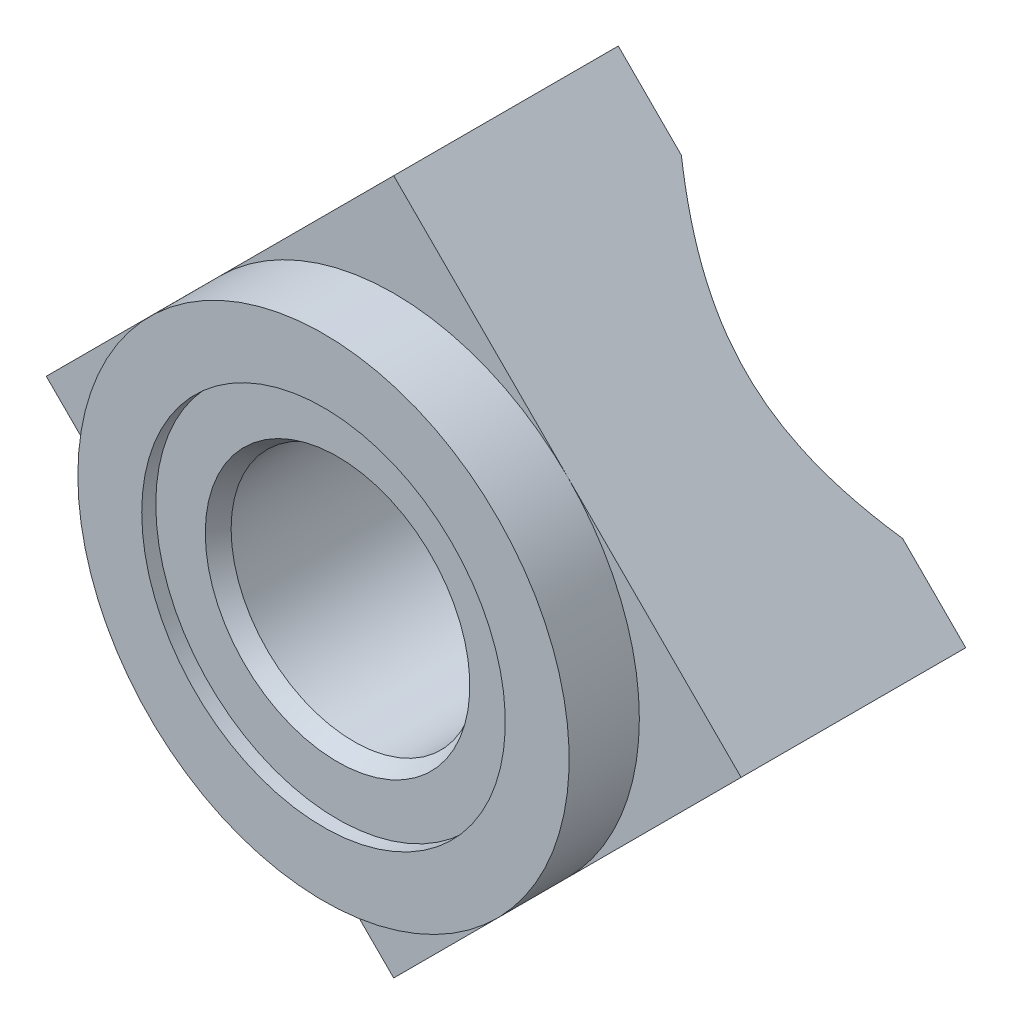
ISO-10303-21;
HEADER;
FILE_DESCRIPTION(('STEP AP214'),'2;1');
FILE_NAME('part.step','',(''),(''),'','','');
FILE_SCHEMA(('AUTOMOTIVE_DESIGN { 1 0 10303 214 1 1 1 1 }'));
ENDSEC;
DATA;
#1=APPLICATION_CONTEXT('core data for automotive mechanical design processes');
#2=APPLICATION_PROTOCOL_DEFINITION('international standard','automotive_design',2000,#1);
#3=PRODUCT_CONTEXT('',#1,'mechanical');
#4=PRODUCT('Part','Part','',(#3));
#5=PRODUCT_RELATED_PRODUCT_CATEGORY('part','',(#4));
#6=PRODUCT_DEFINITION_FORMATION('','',#4);
#7=PRODUCT_DEFINITION_CONTEXT('part definition',#1,'design');
#8=PRODUCT_DEFINITION('design','',#6,#7);
#9=PRODUCT_DEFINITION_SHAPE('','',#8);
#10=(LENGTH_UNIT() NAMED_UNIT(*) SI_UNIT(.MILLI.,.METRE.));
#11=(NAMED_UNIT(*) PLANE_ANGLE_UNIT() SI_UNIT($,.RADIAN.));
#12=(NAMED_UNIT(*) SI_UNIT($,.STERADIAN.) SOLID_ANGLE_UNIT());
#13=UNCERTAINTY_MEASURE_WITH_UNIT(LENGTH_MEASURE(1.E-05),#10,'distance_accuracy_value','');
#14=(GEOMETRIC_REPRESENTATION_CONTEXT(3) GLOBAL_UNCERTAINTY_ASSIGNED_CONTEXT((#13)) GLOBAL_UNIT_ASSIGNED_CONTEXT((#10,
#11,#12)) REPRESENTATION_CONTEXT('',''));
#15=CARTESIAN_POINT('',(0.,0.,0.));
#16=DIRECTION('',(0.,0.,1.));
#17=DIRECTION('',(1.,0.,0.));
#18=AXIS2_PLACEMENT_3D('',#15,#16,#17);
#19=CARTESIAN_POINT('',(4.94974746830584,0.,-3.5));
#20=DIRECTION('',(0.707106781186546,0.707106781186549,0.));
#21=DIRECTION('',(-0.707106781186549,0.707106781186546,0.));
#22=AXIS2_PLACEMENT_3D('',#19,#20,#21);
#23=PLANE('',#22);
#24=DIRECTION('',(0.707106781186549,-0.707106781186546,0.));
#25=VECTOR('',#24,1.);
#26=CARTESIAN_POINT('',(4.94974746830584,0.,-4.2));
#27=LINE('',#26,#25);
#28=CARTESIAN_POINT('',(4.05132608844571,0.898421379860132,-4.2));
#29=VERTEX_POINT('',#28);
#30=CARTESIAN_POINT('',(4.94974746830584,0.,-4.2));
#31=VERTEX_POINT('',#30);
#32=EDGE_CURVE('E131',#29,#31,#27,.T.);
#33=ORIENTED_EDGE('',*,*,#32,.F.);
#34=CARTESIAN_POINT('',(4.05158930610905,0.898158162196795,-4.2002));
#35=CARTESIAN_POINT('',(3.96417902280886,0.985568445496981,-4.13384331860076));
#36=CARTESIAN_POINT('',(3.87556546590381,1.07418200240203,-4.07037538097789));
#37=CARTESIAN_POINT('',(3.6953524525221,1.25439501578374,-3.95105561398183));
#38=CARTESIAN_POINT('',(3.60374160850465,1.34600585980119,-3.89523839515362));
#39=CARTESIAN_POINT('',(3.41825298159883,1.531494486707,-3.79396980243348));
#40=CARTESIAN_POINT('',(3.32439127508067,1.62535619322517,-3.74846063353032));
#41=CARTESIAN_POINT('',(3.13420994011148,1.81553752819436,-3.67005502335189));
#42=CARTESIAN_POINT('',(3.03789560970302,1.91185185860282,-3.63713350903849));
#43=CARTESIAN_POINT('',(2.86766560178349,2.08208186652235,-3.59260854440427));
#44=CARTESIAN_POINT('',(2.79417807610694,2.1555693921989,-3.57773163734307));
#45=CARTESIAN_POINT('',(2.64654165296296,2.30320581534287,-3.55712538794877));
#46=CARTESIAN_POINT('',(2.57239267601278,2.37735479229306,-3.5513971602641));
#47=CARTESIAN_POINT('',(2.42404041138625,2.52570705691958,-3.5494192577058));
#48=CARTESIAN_POINT('',(2.34983713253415,2.59991033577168,-3.55316828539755));
#49=CARTESIAN_POINT('',(2.20197940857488,2.74776805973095,-3.56992163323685));
#50=CARTESIAN_POINT('',(2.12832488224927,2.82142258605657,-3.58292455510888));
#51=CARTESIAN_POINT('',(1.95384873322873,2.9958987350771,-3.62418583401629));
#52=CARTESIAN_POINT('',(1.85349168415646,3.09625578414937,-3.65639132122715));
#53=CARTESIAN_POINT('',(1.65540073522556,3.29434673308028,-3.73466421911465));
#54=CARTESIAN_POINT('',(1.55767204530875,3.39207542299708,-3.78075722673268));
#55=CARTESIAN_POINT('',(1.36443486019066,3.58531260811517,-3.88431334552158));
#56=CARTESIAN_POINT('',(1.26894990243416,3.68079756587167,-3.94186311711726));
#57=CARTESIAN_POINT('',(1.12809234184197,3.82165512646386,-4.03449764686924));
#58=CARTESIAN_POINT('',(1.08163267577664,3.86811479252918,-4.06635186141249));
#59=CARTESIAN_POINT('',(0.989398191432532,3.9603492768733,-4.13193181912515));
#60=CARTESIAN_POINT('',(0.943623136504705,4.00612433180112,-4.16565689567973));
#61=CARTESIAN_POINT('',(0.89815816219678,4.05158930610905,-4.2002));
#62=B_SPLINE_CURVE_WITH_KNOTS('',3,(#34,#35,#36,#37,#38,#39,#40,#41,#42,#43,#44,#45,#46,#47,#48,
#49,#50,#51,#52,#53,#54,#55,#56,#57,#58,#59,#60,#61),.UNSPECIFIED.,.F.,.F.,(4,2,2,2,2,2,2,2,2,2,
2,2,2,4),(0.,0.421065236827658,0.843976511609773,1.26445444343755,1.68409041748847,
1.99868446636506,2.31331684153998,2.62790614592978,2.942447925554,3.37815706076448,
3.81467424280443,4.25462815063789,4.47366033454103,4.69261496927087),.UNSPECIFIED.);
#63=CARTESIAN_POINT('',(0.898421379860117,4.05132608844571,-4.2));
#64=VERTEX_POINT('',#63);
#65=EDGE_CURVE('E57',#29,#64,#62,.T.);
#66=ORIENTED_EDGE('',*,*,#65,.T.);
#67=CARTESIAN_POINT('',(0.,4.94974746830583,-4.2));
#68=VERTEX_POINT('',#67);
#69=EDGE_CURVE('E129',#68,#64,#27,.T.);
#70=ORIENTED_EDGE('',*,*,#69,.F.);
#71=DIRECTION('',(0.,0.,1.));
#72=VECTOR('',#71,1.);
#73=CARTESIAN_POINT('',(0.,4.94974746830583,-3.5));
#74=LINE('',#73,#72);
#75=CARTESIAN_POINT('',(0.,4.94974746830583,-1.00000000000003));
#76=VERTEX_POINT('',#75);
#77=EDGE_CURVE('E172',#68,#76,#74,.T.);
#78=ORIENTED_EDGE('',*,*,#77,.T.);
#79=DIRECTION('',(-0.707106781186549,0.707106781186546,0.));
#80=VECTOR('',#79,1.);
#81=CARTESIAN_POINT('',(4.94974746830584,0.,-1.00000000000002));
#82=LINE('',#81,#80);
#83=CARTESIAN_POINT('',(2.47487373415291,2.47487373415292,-1.));
#84=VERTEX_POINT('',#83);
#85=EDGE_CURVE('E155',#84,#76,#82,.T.);
#86=ORIENTED_EDGE('',*,*,#85,.F.);
#87=CARTESIAN_POINT('',(4.94974746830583,0.,-1.00000000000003));
#88=VERTEX_POINT('',#87);
#89=EDGE_CURVE('E158',#88,#84,#82,.T.);
#90=ORIENTED_EDGE('',*,*,#89,.F.);
#91=DIRECTION('',(0.,0.,1.));
#92=VECTOR('',#91,1.);
#93=CARTESIAN_POINT('',(4.94974746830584,0.,-3.5));
#94=LINE('',#93,#92);
#95=EDGE_CURVE('E162',#31,#88,#94,.T.);
#96=ORIENTED_EDGE('',*,*,#95,.F.);
#97=EDGE_LOOP('',(#33,#66,#70,#78,#86,#90,#96));
#98=FACE_BOUND('',#97,.T.);
#99=ADVANCED_FACE('F41',(#98),#23,.T.);
#100=CARTESIAN_POINT('',(0.,-4.94974746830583,-3.5));
#101=DIRECTION('',(0.707106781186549,-0.707106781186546,0.));
#102=DIRECTION('',(0.707106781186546,0.707106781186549,0.));
#103=AXIS2_PLACEMENT_3D('',#100,#101,#102);
#104=PLANE('',#103);
#105=DIRECTION('',(-0.707106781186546,-0.707106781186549,0.));
#106=VECTOR('',#105,1.);
#107=CARTESIAN_POINT('',(0.,-4.94974746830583,-4.2));
#108=LINE('',#107,#106);
#109=CARTESIAN_POINT('',(0.898421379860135,-4.05132608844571,-4.2));
#110=VERTEX_POINT('',#109);
#111=CARTESIAN_POINT('',(0.,-4.94974746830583,-4.2));
#112=VERTEX_POINT('',#111);
#113=EDGE_CURVE('E198',#110,#112,#108,.T.);
#114=ORIENTED_EDGE('',*,*,#113,.F.);
#115=CARTESIAN_POINT('',(0.898158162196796,-4.05158930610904,-4.2002));
#116=CARTESIAN_POINT('',(0.985568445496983,-3.96417902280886,-4.13384331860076));
#117=CARTESIAN_POINT('',(1.07418200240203,-3.87556546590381,-4.07037538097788));
#118=CARTESIAN_POINT('',(1.25439501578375,-3.69535245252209,-3.95105561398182));
#119=CARTESIAN_POINT('',(1.3460058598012,-3.60374160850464,-3.89523839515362));
#120=CARTESIAN_POINT('',(1.53149448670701,-3.41825298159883,-3.79396980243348));
#121=CARTESIAN_POINT('',(1.62535619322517,-3.32439127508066,-3.74846063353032));
#122=CARTESIAN_POINT('',(1.81553752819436,-3.13420994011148,-3.67005502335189));
#123=CARTESIAN_POINT('',(1.91185185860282,-3.03789560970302,-3.63713350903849));
#124=CARTESIAN_POINT('',(2.08208186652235,-2.86766560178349,-3.59260854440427));
#125=CARTESIAN_POINT('',(2.1555693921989,-2.79417807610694,-3.57773163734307));
#126=CARTESIAN_POINT('',(2.30320581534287,-2.64654165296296,-3.55712538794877));
#127=CARTESIAN_POINT('',(2.37735479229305,-2.57239267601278,-3.5513971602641));
#128=CARTESIAN_POINT('',(2.52570705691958,-2.42404041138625,-3.5494192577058));
#129=CARTESIAN_POINT('',(2.59991033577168,-2.34983713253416,-3.55316828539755));
#130=CARTESIAN_POINT('',(2.74776805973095,-2.20197940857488,-3.56992163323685));
#131=CARTESIAN_POINT('',(2.82142258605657,-2.12832488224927,-3.58292455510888));
#132=CARTESIAN_POINT('',(2.99589873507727,-1.95384873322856,-3.62418583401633));
#133=CARTESIAN_POINT('',(3.09625578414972,-1.85349168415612,-3.65639132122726));
#134=CARTESIAN_POINT('',(3.29434673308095,-1.65540073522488,-3.73466421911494));
#135=CARTESIAN_POINT('',(3.39207542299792,-1.55767204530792,-3.78075722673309));
#136=CARTESIAN_POINT('',(3.58531260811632,-1.36443486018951,-3.88431334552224));
#137=CARTESIAN_POINT('',(3.68079756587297,-1.26894990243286,-3.94186311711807));
#138=CARTESIAN_POINT('',(3.82165512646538,-1.12809234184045,-4.03449764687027));
#139=CARTESIAN_POINT('',(3.86811479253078,-1.08163267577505,-4.06635186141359));
#140=CARTESIAN_POINT('',(3.96034927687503,-0.989398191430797,-4.13193181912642));
#141=CARTESIAN_POINT('',(4.00612433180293,-0.9436231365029,-4.16565689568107));
#142=CARTESIAN_POINT('',(4.05158930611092,-0.898158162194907,-4.20020000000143));
#143=B_SPLINE_CURVE_WITH_KNOTS('',3,(#115,#116,#117,#118,#119,#120,#121,#122,#123,#124,#125,
#126,#127,#128,#129,#130,#131,#132,#133,#134,#135,#136,#137,#138,#139,#140,#141,#142),
.UNSPECIFIED.,.F.,.F.,(4,2,2,2,2,2,2,2,2,2,2,2,2,4),(0.,0.421065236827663,0.843976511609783,
1.26445444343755,1.68409041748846,1.99868446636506,2.31331684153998,2.62790614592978,
2.942447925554,3.37815706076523,3.81467424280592,4.25462815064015,4.47366033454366,
4.69261496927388),.UNSPECIFIED.);
#144=CARTESIAN_POINT('',(4.05132608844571,-0.89842137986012,-4.2));
#145=VERTEX_POINT('',#144);
#146=EDGE_CURVE('E133',#110,#145,#143,.T.);
#147=ORIENTED_EDGE('',*,*,#146,.T.);
#148=EDGE_CURVE('E196',#31,#145,#108,.T.);
#149=ORIENTED_EDGE('',*,*,#148,.F.);
#150=ORIENTED_EDGE('',*,*,#95,.T.);
#151=DIRECTION('',(0.707106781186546,0.707106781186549,0.));
#152=VECTOR('',#151,1.);
#153=CARTESIAN_POINT('',(0.,-4.94974746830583,-1.00000000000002));
#154=LINE('',#153,#152);
#155=CARTESIAN_POINT('',(2.47487373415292,-2.47487373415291,-1.));
#156=VERTEX_POINT('',#155);
#157=EDGE_CURVE('E159',#156,#88,#154,.T.);
#158=ORIENTED_EDGE('',*,*,#157,.F.);
#159=CARTESIAN_POINT('',(0.,-4.94974746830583,-1.00000000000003));
#160=VERTEX_POINT('',#159);
#161=EDGE_CURVE('E161',#160,#156,#154,.T.);
#162=ORIENTED_EDGE('',*,*,#161,.F.);
#163=DIRECTION('',(0.,0.,1.));
#164=VECTOR('',#163,1.);
#165=CARTESIAN_POINT('',(0.,-4.94974746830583,-3.5));
#166=LINE('',#165,#164);
#167=EDGE_CURVE('E166',#112,#160,#166,.T.);
#168=ORIENTED_EDGE('',*,*,#167,.F.);
#169=EDGE_LOOP('',(#114,#147,#149,#150,#158,#162,#168));
#170=FACE_BOUND('',#169,.T.);
#171=ADVANCED_FACE('F195',(#170),#104,.T.);
#172=CARTESIAN_POINT('',(-4.94974746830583,0.,-3.5));
#173=DIRECTION('',(-0.707106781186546,-0.707106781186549,0.));
#174=DIRECTION('',(0.707106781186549,-0.707106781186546,0.));
#175=AXIS2_PLACEMENT_3D('',#172,#173,#174);
#176=PLANE('',#175);
#177=DIRECTION('',(-0.707106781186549,0.707106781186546,0.));
#178=VECTOR('',#177,1.);
#179=CARTESIAN_POINT('',(-4.94974746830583,0.,-4.2));
#180=LINE('',#179,#178);
#181=CARTESIAN_POINT('',(-4.05132608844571,-0.898421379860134,-4.2));
#182=VERTEX_POINT('',#181);
#183=CARTESIAN_POINT('',(-4.94974746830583,0.,-4.2));
#184=VERTEX_POINT('',#183);
#185=EDGE_CURVE('E202',#182,#184,#180,.T.);
#186=ORIENTED_EDGE('',*,*,#185,.F.);
#187=CARTESIAN_POINT('',(-4.05158930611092,-0.898158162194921,-4.20020000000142));
#188=CARTESIAN_POINT('',(-3.9641790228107,-0.985568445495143,-4.1338433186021));
#189=CARTESIAN_POINT('',(-3.87556546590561,-1.07418200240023,-4.07037538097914));
#190=CARTESIAN_POINT('',(-3.69535245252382,-1.25439501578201,-3.95105561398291));
#191=CARTESIAN_POINT('',(-3.60374160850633,-1.3460058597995,-3.89523839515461));
#192=CARTESIAN_POINT('',(-3.41825298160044,-1.5314944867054,-3.79396980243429));
#193=CARTESIAN_POINT('',(-3.32439127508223,-1.62535619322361,-3.74846063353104));
#194=CARTESIAN_POINT('',(-3.13420994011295,-1.81553752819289,-3.67005502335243));
#195=CARTESIAN_POINT('',(-3.03789560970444,-1.9118518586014,-3.63713350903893));
#196=CARTESIAN_POINT('',(-2.86766560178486,-2.08208186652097,-3.59260854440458));
#197=CARTESIAN_POINT('',(-2.79417807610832,-2.15556939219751,-3.57773163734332));
#198=CARTESIAN_POINT('',(-2.64654165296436,-2.30320581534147,-3.55712538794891));
#199=CARTESIAN_POINT('',(-2.57239267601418,-2.37735479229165,-3.55139716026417));
#200=CARTESIAN_POINT('',(-2.42404041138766,-2.52570705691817,-3.54941925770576));
#201=CARTESIAN_POINT('',(-2.34983713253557,-2.59991033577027,-3.55316828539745));
#202=CARTESIAN_POINT('',(-2.20197940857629,-2.74776805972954,-3.56992163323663));
#203=CARTESIAN_POINT('',(-2.12832488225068,-2.82142258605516,-3.5829245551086));
#204=CARTESIAN_POINT('',(-1.95384873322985,-2.99589873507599,-3.62418583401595));
#205=CARTESIAN_POINT('',(-1.85349168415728,-3.09625578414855,-3.65639132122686));
#206=CARTESIAN_POINT('',(-1.65540073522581,-3.29434673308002,-3.73466421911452));
#207=CARTESIAN_POINT('',(-1.55767204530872,-3.39207542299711,-3.78075722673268));
#208=CARTESIAN_POINT('',(-1.36443486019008,-3.58531260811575,-3.88431334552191));
#209=CARTESIAN_POINT('',(-1.2689499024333,-3.68079756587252,-3.94186311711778));
#210=CARTESIAN_POINT('',(-1.12809234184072,-3.8216551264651,-4.03449764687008));
#211=CARTESIAN_POINT('',(-1.08163267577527,-3.86811479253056,-4.06635186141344));
#212=CARTESIAN_POINT('',(-0.989398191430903,-3.96034927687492,-4.13193181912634));
#213=CARTESIAN_POINT('',(-0.943623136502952,-4.00612433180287,-4.16565689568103));
#214=CARTESIAN_POINT('',(-0.898158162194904,-4.05158930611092,-4.20020000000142));
#215=B_SPLINE_CURVE_WITH_KNOTS('',3,(#187,#188,#189,#190,#191,#192,#193,#194,#195,#196,#197,
#198,#199,#200,#201,#202,#203,#204,#205,#206,#207,#208,#209,#210,#211,#212,#213,#214),
.UNSPECIFIED.,.F.,.F.,(4,2,2,2,2,2,2,2,2,2,2,2,2,4),(0.,0.421065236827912,0.843976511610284,
1.26445444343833,1.68409041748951,1.99868446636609,2.313316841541,2.62790614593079,
2.94244792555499,3.3781570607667,3.81467424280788,4.25462815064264,4.47366033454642,
4.69261496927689),.UNSPECIFIED.);
#216=CARTESIAN_POINT('',(-0.898421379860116,-4.05132608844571,-4.2));
#217=VERTEX_POINT('',#216);
#218=EDGE_CURVE('E199',#182,#217,#215,.T.);
#219=ORIENTED_EDGE('',*,*,#218,.T.);
#220=EDGE_CURVE('E204',#112,#217,#180,.T.);
#221=ORIENTED_EDGE('',*,*,#220,.F.);
#222=ORIENTED_EDGE('',*,*,#167,.T.);
#223=DIRECTION('',(0.707106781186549,-0.707106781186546,0.));
#224=VECTOR('',#223,1.);
#225=CARTESIAN_POINT('',(-4.94974746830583,0.,-1.00000000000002));
#226=LINE('',#225,#224);
#227=CARTESIAN_POINT('',(-2.47487373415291,-2.47487373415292,-1.));
#228=VERTEX_POINT('',#227);
#229=EDGE_CURVE('E156',#228,#160,#226,.T.);
#230=ORIENTED_EDGE('',*,*,#229,.F.);
#231=CARTESIAN_POINT('',(-4.94974746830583,0.,-1.00000000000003));
#232=VERTEX_POINT('',#231);
#233=EDGE_CURVE('E153',#232,#228,#226,.T.);
#234=ORIENTED_EDGE('',*,*,#233,.F.);
#235=DIRECTION('',(0.,0.,1.));
#236=VECTOR('',#235,1.);
#237=CARTESIAN_POINT('',(-4.94974746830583,0.,-3.5));
#238=LINE('',#237,#236);
#239=EDGE_CURVE('E169',#184,#232,#238,.T.);
#240=ORIENTED_EDGE('',*,*,#239,.F.);
#241=EDGE_LOOP('',(#186,#219,#221,#222,#230,#234,#240));
#242=FACE_BOUND('',#241,.T.);
#243=ADVANCED_FACE('F259',(#242),#176,.T.);
#244=CARTESIAN_POINT('',(0.,4.94974746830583,-3.5));
#245=DIRECTION('',(-0.707106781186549,0.707106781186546,0.));
#246=DIRECTION('',(-0.707106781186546,-0.707106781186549,0.));
#247=AXIS2_PLACEMENT_3D('',#244,#245,#246);
#248=PLANE('',#247);
#249=DIRECTION('',(0.707106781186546,0.707106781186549,0.));
#250=VECTOR('',#249,1.);
#251=CARTESIAN_POINT('',(0.,4.94974746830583,-4.2));
#252=LINE('',#251,#250);
#253=CARTESIAN_POINT('',(-0.898421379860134,4.05132608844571,-4.2));
#254=VERTEX_POINT('',#253);
#255=EDGE_CURVE('E136',#254,#68,#252,.T.);
#256=ORIENTED_EDGE('',*,*,#255,.F.);
#257=CARTESIAN_POINT('',(-0.898158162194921,4.05158930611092,-4.20020000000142));
#258=CARTESIAN_POINT('',(-0.985568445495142,3.9641790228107,-4.1338433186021));
#259=CARTESIAN_POINT('',(-1.07418200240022,3.87556546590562,-4.07037538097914));
#260=CARTESIAN_POINT('',(-1.25439501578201,3.69535245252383,-3.95105561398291));
#261=CARTESIAN_POINT('',(-1.3460058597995,3.60374160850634,-3.89523839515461));
#262=CARTESIAN_POINT('',(-1.53149448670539,3.41825298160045,-3.79396980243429));
#263=CARTESIAN_POINT('',(-1.6253561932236,3.32439127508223,-3.74846063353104));
#264=CARTESIAN_POINT('',(-1.81553752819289,3.13420994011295,-3.67005502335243));
#265=CARTESIAN_POINT('',(-1.91185185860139,3.03789560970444,-3.63713350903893));
#266=CARTESIAN_POINT('',(-2.08208186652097,2.86766560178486,-3.59260854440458));
#267=CARTESIAN_POINT('',(-2.15556939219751,2.79417807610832,-3.57773163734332));
#268=CARTESIAN_POINT('',(-2.30320581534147,2.64654165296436,-3.55712538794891));
#269=CARTESIAN_POINT('',(-2.37735479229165,2.57239267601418,-3.55139716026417));
#270=CARTESIAN_POINT('',(-2.52570705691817,2.42404041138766,-3.54941925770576));
#271=CARTESIAN_POINT('',(-2.59991033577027,2.34983713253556,-3.55316828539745));
#272=CARTESIAN_POINT('',(-2.74776805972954,2.20197940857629,-3.56992163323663));
#273=CARTESIAN_POINT('',(-2.82142258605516,2.12832488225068,-3.5829245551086));
#274=CARTESIAN_POINT('',(-2.99589873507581,1.95384873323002,-3.62418583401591));
#275=CARTESIAN_POINT('',(-3.09625578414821,1.85349168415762,-3.65639132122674));
#276=CARTESIAN_POINT('',(-3.29434673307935,1.65540073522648,-3.73466421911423));
#277=CARTESIAN_POINT('',(-3.39207542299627,1.55767204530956,-3.78075722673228));
#278=CARTESIAN_POINT('',(-3.5853126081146,1.36443486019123,-3.88431334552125));
#279=CARTESIAN_POINT('',(-3.68079756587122,1.26894990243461,-3.94186311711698));
#280=CARTESIAN_POINT('',(-3.82165512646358,1.12809234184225,-4.03449764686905));
#281=CARTESIAN_POINT('',(-3.86811479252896,1.08163267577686,-4.06635186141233));
#282=CARTESIAN_POINT('',(-3.96034927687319,0.98939819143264,-4.13193181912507));
#283=CARTESIAN_POINT('',(-4.00612433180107,0.943623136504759,-4.16565689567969));
#284=CARTESIAN_POINT('',(-4.05158930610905,0.89815816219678,-4.2002));
#285=B_SPLINE_CURVE_WITH_KNOTS('',3,(#257,#258,#259,#260,#261,#262,#263,#264,#265,#266,#267,
#268,#269,#270,#271,#272,#273,#274,#275,#276,#277,#278,#279,#280,#281,#282,#283,#284),
.UNSPECIFIED.,.F.,.F.,(4,2,2,2,2,2,2,2,2,2,2,2,2,4),(0.,0.421065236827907,0.843976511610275,
1.26445444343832,1.68409041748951,1.99868446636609,2.313316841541,2.62790614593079,
2.942447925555,3.37815706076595,3.81467424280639,4.25462815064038,4.47366033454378,
4.69261496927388),.UNSPECIFIED.);
#286=CARTESIAN_POINT('',(-4.05132608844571,0.898421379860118,-4.2));
#287=VERTEX_POINT('',#286);
#288=EDGE_CURVE('E121',#254,#287,#285,.T.);
#289=ORIENTED_EDGE('',*,*,#288,.T.);
#290=EDGE_CURVE('E142',#184,#287,#252,.T.);
#291=ORIENTED_EDGE('',*,*,#290,.F.);
#292=ORIENTED_EDGE('',*,*,#239,.T.);
#293=DIRECTION('',(-0.707106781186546,-0.707106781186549,0.));
#294=VECTOR('',#293,1.);
#295=CARTESIAN_POINT('',(0.,4.94974746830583,-1.00000000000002));
#296=LINE('',#295,#294);
#297=CARTESIAN_POINT('',(-2.47487373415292,2.47487373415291,-1.));
#298=VERTEX_POINT('',#297);
#299=EDGE_CURVE('E176',#298,#232,#296,.T.);
#300=ORIENTED_EDGE('',*,*,#299,.F.);
#301=EDGE_CURVE('E178',#76,#298,#296,.T.);
#302=ORIENTED_EDGE('',*,*,#301,.F.);
#303=ORIENTED_EDGE('',*,*,#77,.F.);
#304=EDGE_LOOP('',(#256,#289,#291,#292,#300,#302,#303));
#305=FACE_BOUND('',#304,.T.);
#306=ADVANCED_FACE('F217',(#305),#248,.T.);
#307=CARTESIAN_POINT('',(4.94974746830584,0.,-4.2));
#308=DIRECTION('',(0.,0.,1.));
#309=DIRECTION('',(1.,0.,0.));
#310=AXIS2_PLACEMENT_3D('',#307,#308,#309);
#311=PLANE('',#310);
#312=CARTESIAN_POINT('',(0.,0.,-4.2));
#313=DIRECTION('',(0.,0.,1.));
#314=DIRECTION('',(1.,0.,0.));
#315=AXIS2_PLACEMENT_3D('',#312,#313,#314);
#316=CIRCLE('',#315,4.14974746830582);
#317=EDGE_CURVE('E11',#110,#217,#316,.F.);
#318=ORIENTED_EDGE('',*,*,#317,.F.);
#319=ORIENTED_EDGE('',*,*,#113,.T.);
#320=ORIENTED_EDGE('',*,*,#220,.T.);
#321=EDGE_LOOP('',(#318,#319,#320));
#322=FACE_BOUND('',#321,.T.);
#323=ADVANCED_FACE('F268',(#322),#311,.F.);
#324=EDGE_CURVE('E50',#182,#287,#316,.F.);
#325=ORIENTED_EDGE('',*,*,#324,.F.);
#326=ORIENTED_EDGE('',*,*,#185,.T.);
#327=ORIENTED_EDGE('',*,*,#290,.T.);
#328=EDGE_LOOP('',(#325,#326,#327));
#329=FACE_BOUND('',#328,.T.);
#330=ADVANCED_FACE('F213',(#329),#311,.F.);
#331=EDGE_CURVE('E118',#254,#64,#316,.F.);
#332=ORIENTED_EDGE('',*,*,#331,.F.);
#333=ORIENTED_EDGE('',*,*,#255,.T.);
#334=ORIENTED_EDGE('',*,*,#69,.T.);
#335=EDGE_LOOP('',(#332,#333,#334));
#336=FACE_BOUND('',#335,.T.);
#337=ADVANCED_FACE('F135',(#336),#311,.F.);
#338=EDGE_CURVE('E45',#29,#145,#316,.F.);
#339=ORIENTED_EDGE('',*,*,#338,.F.);
#340=ORIENTED_EDGE('',*,*,#32,.T.);
#341=ORIENTED_EDGE('',*,*,#148,.T.);
#342=EDGE_LOOP('',(#339,#340,#341));
#343=FACE_BOUND('',#342,.T.);
#344=ADVANCED_FACE('F201',(#343),#311,.F.);
#345=CARTESIAN_POINT('',(0.,-3.5,-1.00000000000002));
#346=DIRECTION('',(0.,0.,-1.));
#347=DIRECTION('',(-1.,0.,0.));
#348=AXIS2_PLACEMENT_3D('',#345,#346,#347);
#349=PLANE('',#348);
#350=ORIENTED_EDGE('',*,*,#161,.T.);
#351=CARTESIAN_POINT('',(0.,0.,-1.));
#352=DIRECTION('',(0.,0.,-1.));
#353=DIRECTION('',(-1.,0.,0.));
#354=AXIS2_PLACEMENT_3D('',#351,#352,#353);
#355=CIRCLE('',#354,3.5);
#356=EDGE_CURVE('E140',#156,#228,#355,.T.);
#357=ORIENTED_EDGE('',*,*,#356,.T.);
#358=ORIENTED_EDGE('',*,*,#229,.T.);
#359=EDGE_LOOP('',(#350,#357,#358));
#360=FACE_BOUND('',#359,.T.);
#361=ADVANCED_FACE('F360',(#360),#349,.F.);
#362=ORIENTED_EDGE('',*,*,#157,.T.);
#363=ORIENTED_EDGE('',*,*,#89,.T.);
#364=EDGE_CURVE('E147',#84,#156,#355,.T.);
#365=ORIENTED_EDGE('',*,*,#364,.T.);
#366=EDGE_LOOP('',(#362,#363,#365));
#367=FACE_BOUND('',#366,.T.);
#368=ADVANCED_FACE('F415',(#367),#349,.F.);
#369=ORIENTED_EDGE('',*,*,#85,.T.);
#370=ORIENTED_EDGE('',*,*,#301,.T.);
#371=EDGE_CURVE('E65',#298,#84,#355,.T.);
#372=ORIENTED_EDGE('',*,*,#371,.T.);
#373=EDGE_LOOP('',(#369,#370,#372));
#374=FACE_BOUND('',#373,.T.);
#375=ADVANCED_FACE('F401',(#374),#349,.F.);
#376=CARTESIAN_POINT('',(0.,0.,-1.04629593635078));
#377=DIRECTION('',(0.,0.,-1.));
#378=DIRECTION('',(-1.,0.,0.));
#379=AXIS2_PLACEMENT_3D('',#376,#377,#378);
#380=CYLINDRICAL_SURFACE('',#379,3.5);
#381=CARTESIAN_POINT('',(0.,0.,0.));
#382=DIRECTION('',(0.,0.,-1.));
#383=DIRECTION('',(-1.,0.,0.));
#384=AXIS2_PLACEMENT_3D('',#381,#382,#383);
#385=CIRCLE('',#384,3.5);
#386=CARTESIAN_POINT('',(-3.5,0.,0.));
#387=VERTEX_POINT('',#386);
#388=EDGE_CURVE('E165',#387,#387,#385,.F.);
#389=ORIENTED_EDGE('',*,*,#388,.F.);
#390=EDGE_LOOP('',(#389));
#391=FACE_BOUND('',#390,.T.);
#392=ORIENTED_EDGE('',*,*,#371,.F.);
#393=EDGE_CURVE('E138',#228,#298,#355,.T.);
#394=ORIENTED_EDGE('',*,*,#393,.F.);
#395=ORIENTED_EDGE('',*,*,#356,.F.);
#396=ORIENTED_EDGE('',*,*,#364,.F.);
#397=EDGE_LOOP('',(#392,#394,#395,#396));
#398=FACE_BOUND('',#397,.T.);
#399=ADVANCED_FACE('F398',(#391,#398),#380,.T.);
#400=ORIENTED_EDGE('',*,*,#233,.T.);
#401=ORIENTED_EDGE('',*,*,#393,.T.);
#402=ORIENTED_EDGE('',*,*,#299,.T.);
#403=EDGE_LOOP('',(#400,#401,#402));
#404=FACE_BOUND('',#403,.T.);
#405=ADVANCED_FACE('F394',(#404),#349,.F.);
#406=CARTESIAN_POINT('',(4.94974746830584,0.,0.));
#407=DIRECTION('',(0.,0.,-1.));
#408=DIRECTION('',(-1.,0.,0.));
#409=AXIS2_PLACEMENT_3D('',#406,#407,#408);
#410=PLANE('',#409);
#411=CARTESIAN_POINT('',(0.,0.,0.));
#412=DIRECTION('',(0.,0.,-1.));
#413=DIRECTION('',(-1.,0.,0.));
#414=AXIS2_PLACEMENT_3D('',#411,#412,#413);
#415=CIRCLE('',#414,2.59);
#416=CARTESIAN_POINT('',(-2.59,0.,0.));
#417=VERTEX_POINT('',#416);
#418=EDGE_CURVE('E150',#417,#417,#415,.T.);
#419=ORIENTED_EDGE('',*,*,#418,.T.);
#420=EDGE_LOOP('',(#419));
#421=FACE_BOUND('',#420,.T.);
#422=ORIENTED_EDGE('',*,*,#388,.T.);
#423=EDGE_LOOP('',(#422));
#424=FACE_BOUND('',#423,.T.);
#425=ADVANCED_FACE('F260',(#421,#424),#410,.F.);
#426=CARTESIAN_POINT('',(0.,-2.59,-0.2));
#427=DIRECTION('',(0.,0.,-1.));
#428=DIRECTION('',(-1.,0.,0.));
#429=AXIS2_PLACEMENT_3D('',#426,#427,#428);
#430=PLANE('',#429);
#431=CARTESIAN_POINT('',(0.,0.,-0.2));
#432=DIRECTION('',(0.,0.,-1.));
#433=DIRECTION('',(-1.,0.,0.));
#434=AXIS2_PLACEMENT_3D('',#431,#432,#433);
#435=CIRCLE('',#434,1.88471506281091);
#436=CARTESIAN_POINT('',(-1.88471506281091,0.,-0.2));
#437=VERTEX_POINT('',#436);
#438=EDGE_CURVE('E184',#437,#437,#435,.T.);
#439=ORIENTED_EDGE('',*,*,#438,.T.);
#440=EDGE_LOOP('',(#439));
#441=FACE_BOUND('',#440,.T.);
#442=CARTESIAN_POINT('',(0.,0.,-0.2));
#443=DIRECTION('',(0.,0.,-1.));
#444=DIRECTION('',(-1.,0.,0.));
#445=AXIS2_PLACEMENT_3D('',#442,#443,#444);
#446=CIRCLE('',#445,2.59);
#447=CARTESIAN_POINT('',(-2.59,0.,-0.2));
#448=VERTEX_POINT('',#447);
#449=EDGE_CURVE('E146',#448,#448,#446,.T.);
#450=ORIENTED_EDGE('',*,*,#449,.F.);
#451=EDGE_LOOP('',(#450));
#452=FACE_BOUND('',#451,.T.);
#453=ADVANCED_FACE('F381',(#441,#452),#430,.F.);
#454=CARTESIAN_POINT('',(0.,0.,-1.04629593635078));
#455=DIRECTION('',(0.,0.,-1.));
#456=DIRECTION('',(-1.,0.,0.));
#457=AXIS2_PLACEMENT_3D('',#454,#455,#456);
#458=CYLINDRICAL_SURFACE('',#457,2.59);
#459=ORIENTED_EDGE('',*,*,#418,.F.);
#460=EDGE_LOOP('',(#459));
#461=FACE_BOUND('',#460,.T.);
#462=ORIENTED_EDGE('',*,*,#449,.T.);
#463=EDGE_LOOP('',(#462));
#464=FACE_BOUND('',#463,.T.);
#465=ADVANCED_FACE('F283',(#461,#464),#458,.F.);
#466=CARTESIAN_POINT('',(0.,0.,0.));
#467=DIRECTION('',(0.,0.,-1.));
#468=DIRECTION('',(-1.,0.,0.));
#469=AXIS2_PLACEMENT_3D('',#466,#467,#468);
#470=CYLINDRICAL_SURFACE('',#469,1.75);
#471=CARTESIAN_POINT('',(0.,0.,-3.3652849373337));
#472=DIRECTION('',(0.,0.,-1.));
#473=DIRECTION('',(-1.,0.,0.));
#474=AXIS2_PLACEMENT_3D('',#471,#472,#473);
#475=CIRCLE('',#474,1.75);
#476=CARTESIAN_POINT('',(-1.75,0.,-3.3652849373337));
#477=VERTEX_POINT('',#476);
#478=EDGE_CURVE('E182',#477,#477,#475,.T.);
#479=CARTESIAN_POINT('',(0.,0.,-0.433333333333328));
#480=DIRECTION('',(0.,0.,-1.));
#481=DIRECTION('',(-1.,0.,0.));
#482=AXIS2_PLACEMENT_3D('',#479,#480,#481);
#483=CIRCLE('',#482,1.75);
#484=CARTESIAN_POINT('',(-1.75,0.,-0.433333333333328));
#485=VERTEX_POINT('',#484);
#486=EDGE_CURVE('E179',#485,#485,#483,.F.);
#487=CARTESIAN_POINT('',(-1.75,0.,-3.3652849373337));
#488=CARTESIAN_POINT('',(-1.75,0.,-3.33474377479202));
#489=CARTESIAN_POINT('',(-1.75,0.,-3.30420261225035));
#490=CARTESIAN_POINT('',(-1.75,0.,-3.24312028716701));
#491=CARTESIAN_POINT('',(-1.75,0.,-3.21257912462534));
#492=CARTESIAN_POINT('',(-1.75,0.,-3.151496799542));
#493=CARTESIAN_POINT('',(-1.75,0.,-3.12095563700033));
#494=CARTESIAN_POINT('',(-1.75,0.,-3.05987331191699));
#495=CARTESIAN_POINT('',(-1.75,0.,-3.02933214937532));
#496=CARTESIAN_POINT('',(-1.75,0.,-2.96824982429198));
#497=CARTESIAN_POINT('',(-1.75,0.,-2.93770866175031));
#498=CARTESIAN_POINT('',(-1.75,0.,-2.87662633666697));
#499=CARTESIAN_POINT('',(-1.75,0.,-2.8460851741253));
#500=CARTESIAN_POINT('',(-1.75,0.,-2.78500284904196));
#501=CARTESIAN_POINT('',(-1.75,0.,-2.75446168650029));
#502=CARTESIAN_POINT('',(-1.75,0.,-2.69337936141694));
#503=CARTESIAN_POINT('',(-1.75,0.,-2.66283819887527));
#504=CARTESIAN_POINT('',(-1.75,0.,-2.60175587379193));
#505=CARTESIAN_POINT('',(-1.75,0.,-2.57121471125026));
#506=CARTESIAN_POINT('',(-1.75,0.,-2.51013238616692));
#507=CARTESIAN_POINT('',(-1.75,0.,-2.47959122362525));
#508=CARTESIAN_POINT('',(-1.75,0.,-2.41850889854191));
#509=CARTESIAN_POINT('',(-1.75,0.,-2.38796773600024));
#510=CARTESIAN_POINT('',(-1.75,0.,-2.3268854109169));
#511=CARTESIAN_POINT('',(-1.75,0.,-2.29634424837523));
#512=CARTESIAN_POINT('',(-1.75,0.,-2.23526192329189));
#513=CARTESIAN_POINT('',(-1.75,0.,-2.20472076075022));
#514=CARTESIAN_POINT('',(-1.75,0.,-2.14363843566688));
#515=CARTESIAN_POINT('',(-1.75,0.,-2.1130972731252));
#516=CARTESIAN_POINT('',(-1.75,0.,-2.05201494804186));
#517=CARTESIAN_POINT('',(-1.75,0.,-2.02147378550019));
#518=CARTESIAN_POINT('',(-1.75,0.,-1.96039146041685));
#519=CARTESIAN_POINT('',(-1.75,0.,-1.92985029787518));
#520=CARTESIAN_POINT('',(-1.75,0.,-1.86876797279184));
#521=CARTESIAN_POINT('',(-1.75,0.,-1.83822681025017));
#522=CARTESIAN_POINT('',(-1.75,0.,-1.77714448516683));
#523=CARTESIAN_POINT('',(-1.75,0.,-1.74660332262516));
#524=CARTESIAN_POINT('',(-1.75,0.,-1.68552099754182));
#525=CARTESIAN_POINT('',(-1.75,0.,-1.65497983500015));
#526=CARTESIAN_POINT('',(-1.75,0.,-1.59389750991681));
#527=CARTESIAN_POINT('',(-1.75,0.,-1.56335634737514));
#528=CARTESIAN_POINT('',(-1.75,0.,-1.5022740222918));
#529=CARTESIAN_POINT('',(-1.75,0.,-1.47173285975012));
#530=CARTESIAN_POINT('',(-1.75,0.,-1.41065053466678));
#531=CARTESIAN_POINT('',(-1.75,0.,-1.38010937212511));
#532=CARTESIAN_POINT('',(-1.75,0.,-1.31902704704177));
#533=CARTESIAN_POINT('',(-1.75,0.,-1.2884858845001));
#534=CARTESIAN_POINT('',(-1.75,0.,-1.22740355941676));
#535=CARTESIAN_POINT('',(-1.75,0.,-1.19686239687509));
#536=CARTESIAN_POINT('',(-1.75,0.,-1.13578007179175));
#537=CARTESIAN_POINT('',(-1.75,0.,-1.10523890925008));
#538=CARTESIAN_POINT('',(-1.75,0.,-1.04415658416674));
#539=CARTESIAN_POINT('',(-1.75,0.,-1.01361542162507));
#540=CARTESIAN_POINT('',(-1.75,0.,-0.952533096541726));
#541=CARTESIAN_POINT('',(-1.75,0.,-0.921991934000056));
#542=CARTESIAN_POINT('',(-1.75,0.,-0.860909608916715));
#543=CARTESIAN_POINT('',(-1.75,0.,-0.830368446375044));
#544=CARTESIAN_POINT('',(-1.75,0.,-0.769286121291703));
#545=CARTESIAN_POINT('',(-1.75,0.,-0.738744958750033));
#546=CARTESIAN_POINT('',(-1.75,0.,-0.677662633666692));
#547=CARTESIAN_POINT('',(-1.75,0.,-0.647121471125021));
#548=CARTESIAN_POINT('',(-1.75,0.,-0.58603914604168));
#549=CARTESIAN_POINT('',(-1.75,0.,-0.55549798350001));
#550=CARTESIAN_POINT('',(-1.75,0.,-0.494415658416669));
#551=CARTESIAN_POINT('',(-1.75,0.,-0.463874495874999));
#552=CARTESIAN_POINT('',(-1.75,0.,-0.433333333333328));
#553=B_SPLINE_CURVE_WITH_KNOTS('',3,(#487,#488,#489,#490,#491,#492,#493,#494,#495,#496,#497,
#498,#499,#500,#501,#502,#503,#504,#505,#506,#507,#508,#509,#510,#511,#512,#513,#514,#515,#516,
#517,#518,#519,#520,#521,#522,#523,#524,#525,#526,#527,#528,#529,#530,#531,#532,#533,#534,#535,
#536,#537,#538,#539,#540,#541,#542,#543,#544,#545,#546,#547,#548,#549,#550,#551,#552),
.UNSPECIFIED.,.F.,.F.,(4,2,2,2,2,2,2,2,2,2,2,2,2,2,2,2,2,2,2,2,2,2,2,2,2,2,2,2,2,2,2,2,4),(0.,
0.0916234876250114,0.183246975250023,0.274870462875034,0.366493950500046,0.458117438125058,
0.549740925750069,0.64136441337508,0.732987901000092,0.824611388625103,0.916234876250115,
1.00785836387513,1.09948185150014,1.19110533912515,1.28272882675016,1.37435231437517,
1.46597580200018,1.55759928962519,1.64922277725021,1.74084626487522,1.83246975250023,
1.92409324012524,2.01571672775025,2.10734021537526,2.19896370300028,2.29058719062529,
2.3822106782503,2.47383416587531,2.56545765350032,2.65708114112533,2.74870462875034,
2.84032811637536,2.93195160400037),.UNSPECIFIED.);
#554=EDGE_CURVE('BSEAM276',#477,#485,#553,.T.);
#555=ORIENTED_EDGE('',*,*,#478,.T.);
#556=ORIENTED_EDGE('',*,*,#486,.T.);
#557=ORIENTED_EDGE('',*,*,#554,.T.);
#558=ORIENTED_EDGE('',*,*,#554,.F.);
#559=EDGE_LOOP('',(#555,#557,#556,#558));
#560=FACE_BOUND('',#559,.T.);
#561=ADVANCED_FACE('F276',(#560),#470,.F.);
#562=CARTESIAN_POINT('',(0.,0.,-3.3652849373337));
#563=DIRECTION('',(0.,0.,-1.));
#564=DIRECTION('',(-1.,0.,0.));
#565=AXIS2_PLACEMENT_3D('',#562,#563,#564);
#566=CONICAL_SURFACE('',#565,1.75,1.0471975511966);
#567=CARTESIAN_POINT('',(0.,0.,-3.50000000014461));
#568=DIRECTION('',(0.,0.,-1.));
#569=DIRECTION('',(-1.,0.,0.));
#570=AXIS2_PLACEMENT_3D('',#567,#568,#569);
#571=CIRCLE('',#570,1.98333333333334);
#572=CARTESIAN_POINT('',(-1.98333333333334,0.,-3.50000000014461));
#573=VERTEX_POINT('',#572);
#574=EDGE_CURVE('E132',#573,#573,#571,.T.);
#575=ORIENTED_EDGE('',*,*,#574,.T.);
#576=EDGE_LOOP('',(#575));
#577=FACE_BOUND('',#576,.T.);
#578=ORIENTED_EDGE('',*,*,#478,.F.);
#579=EDGE_LOOP('',(#578));
#580=FACE_BOUND('',#579,.T.);
#581=ADVANCED_FACE('F274',(#577,#580),#566,.F.);
#582=CARTESIAN_POINT('',(0.,0.,-0.2));
#583=DIRECTION('',(0.,0.,1.));
#584=DIRECTION('',(1.,0.,0.));
#585=AXIS2_PLACEMENT_3D('',#582,#583,#584);
#586=CONICAL_SURFACE('',#585,1.88471506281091,0.523598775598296);
#587=ORIENTED_EDGE('',*,*,#486,.F.);
#588=EDGE_LOOP('',(#587));
#589=FACE_BOUND('',#588,.T.);
#590=ORIENTED_EDGE('',*,*,#438,.F.);
#591=EDGE_LOOP('',(#590));
#592=FACE_BOUND('',#591,.T.);
#593=ADVANCED_FACE('F43',(#589,#592),#586,.F.);
#594=CARTESIAN_POINT('',(0.,0.,-3.50000000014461));
#595=DIRECTION('',(0.,0.,-1.));
#596=DIRECTION('',(-1.,0.,0.));
#597=AXIS2_PLACEMENT_3D('',#594,#595,#596);
#598=PLANE('',#597);
#599=ORIENTED_EDGE('',*,*,#574,.F.);
#600=EDGE_LOOP('',(#599));
#601=FACE_BOUND('',#600,.T.);
#602=CARTESIAN_POINT('',(0.,0.,-3.50000000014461));
#603=DIRECTION('',(0.,0.,1.));
#604=DIRECTION('',(1.,0.,0.));
#605=AXIS2_PLACEMENT_3D('',#602,#603,#604);
#606=CIRCLE('',#605,3.44974746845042);
#607=CARTESIAN_POINT('',(3.44974746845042,0.,-3.50000000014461));
#608=VERTEX_POINT('',#607);
#609=EDGE_CURVE('E219',#608,#608,#606,.T.);
#610=ORIENTED_EDGE('',*,*,#609,.F.);
#611=EDGE_LOOP('',(#610));
#612=FACE_BOUND('',#611,.T.);
#613=ADVANCED_FACE('F241',(#601,#612),#598,.T.);
#614=CARTESIAN_POINT('',(0.,0.,-4.2));
#615=DIRECTION('',(0.,0.,-1.));
#616=DIRECTION('',(-1.,0.,0.));
#617=AXIS2_PLACEMENT_3D('',#614,#615,#616);
#618=CONICAL_SURFACE('',#617,4.14974746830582,0.785398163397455);
#619=ORIENTED_EDGE('',*,*,#609,.T.);
#620=EDGE_LOOP('',(#619));
#621=FACE_BOUND('',#620,.T.);
#622=ORIENTED_EDGE('',*,*,#338,.T.);
#623=ORIENTED_EDGE('',*,*,#146,.F.);
#624=ORIENTED_EDGE('',*,*,#317,.T.);
#625=ORIENTED_EDGE('',*,*,#218,.F.);
#626=ORIENTED_EDGE('',*,*,#324,.T.);
#627=ORIENTED_EDGE('',*,*,#288,.F.);
#628=ORIENTED_EDGE('',*,*,#331,.T.);
#629=ORIENTED_EDGE('',*,*,#65,.F.);
#630=EDGE_LOOP('',(#622,#623,#624,#625,#626,#627,#628,#629));
#631=FACE_BOUND('',#630,.T.);
#632=ADVANCED_FACE('F119',(#621,#631),#618,.F.);
#633=CLOSED_SHELL('',(#99,#171,#243,#306,#323,#330,#337,#344,#361,#368,#375,#399,#405,#425,#453,
#465,#561,#581,#593,#613,#632));
#634=MANIFOLD_SOLID_BREP('B2',#633);
#635=ADVANCED_BREP_SHAPE_REPRESENTATION('',(#18,#634),#14);
#636=SHAPE_DEFINITION_REPRESENTATION(#9,#635);
ENDSEC;
END-ISO-10303-21;
